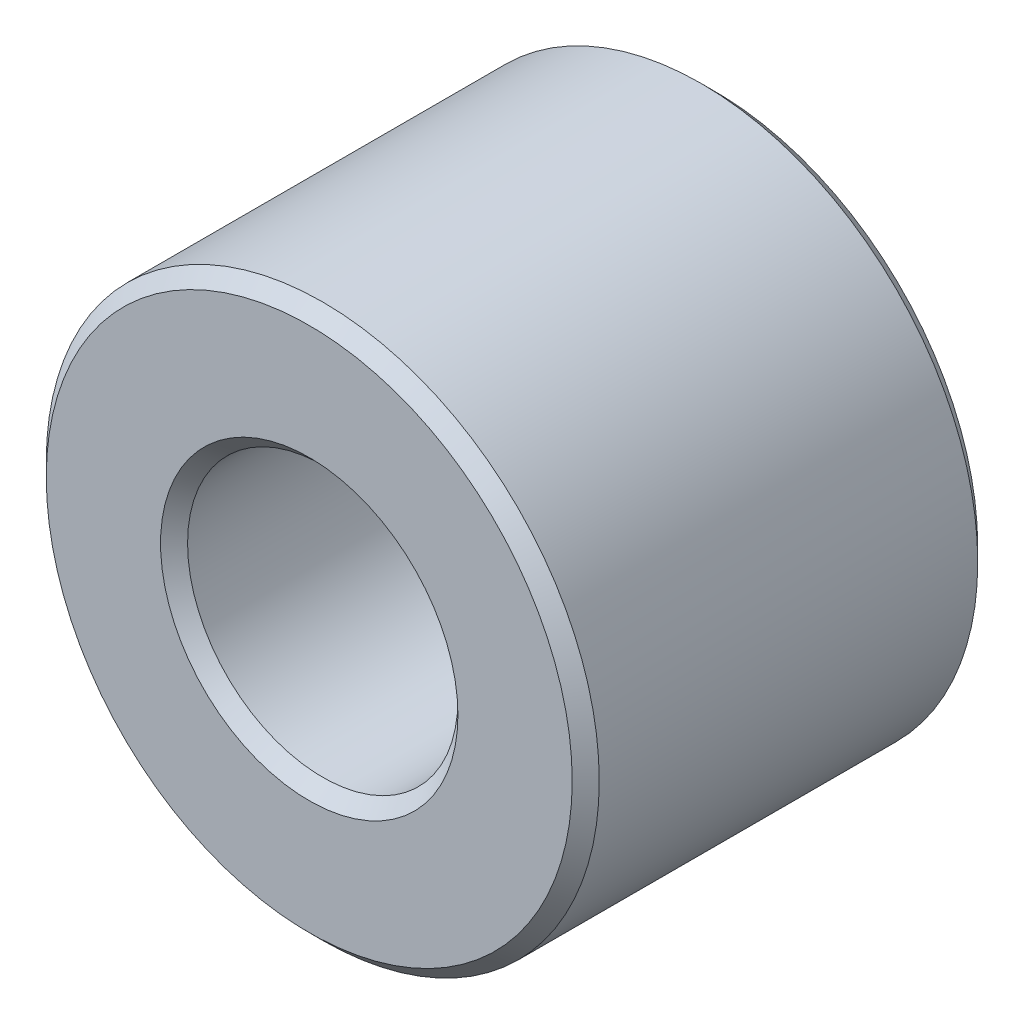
from build123d import *

# Parameters (mm, degrees)
SKETCH1_R           = 22.5
SKETCH1_R_2         = 11
BOSS_EXTRUDE1_DEPTH = 16.5
CHAMFER1_SIZE       = 1.1


with BuildPart() as part:
    # Sketch1 → Boss-Extrude1 (new, symmetric)
    with BuildSketch(Plane.XY):
        Circle(SKETCH1_R)
        Circle(SKETCH1_R_2, mode=Mode.SUBTRACT)
    extrude(amount=BOSS_EXTRUDE1_DEPTH, both=True)

    # Chamfer1
    chamfer1_edges = [part.edges().sort_by_distance(p)[0] for p in [
        (-22.5, 0, -16.5),
        (-22.5, 0, 16.5),
        (-11, 0, -16.5),
        (-11, 0, 16.5),
    ]]
    chamfer(chamfer1_edges, length=CHAMFER1_SIZE)


solid = part.part
